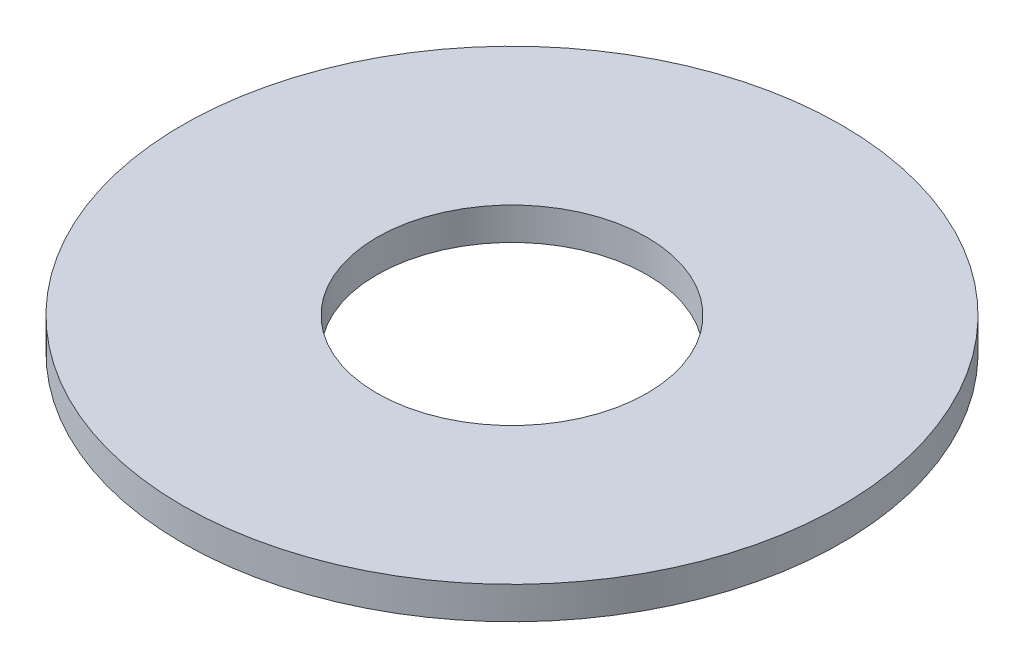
from build123d import *

# Parameters (mm, degrees)
ESQUISSE1_W = 9
ESQUISSE1_H = 1.5


with BuildPart() as part:
    # Esquisse1 → Base-R_volution (revolve)
    with BuildSketch(Plane.XY, mode=Mode.PRIVATE) as base_r_volution_sk:
        with Locations((10.75, 0.75)):
            Rectangle(ESQUISSE1_W, ESQUISSE1_H)
    revolve(base_r_volution_sk.sketch.rotate(Axis((0, 40, 0), (0, -1, 0)), 90), axis=Axis((0, 40, 0), (0, -1, 0)))


solid = part.part
